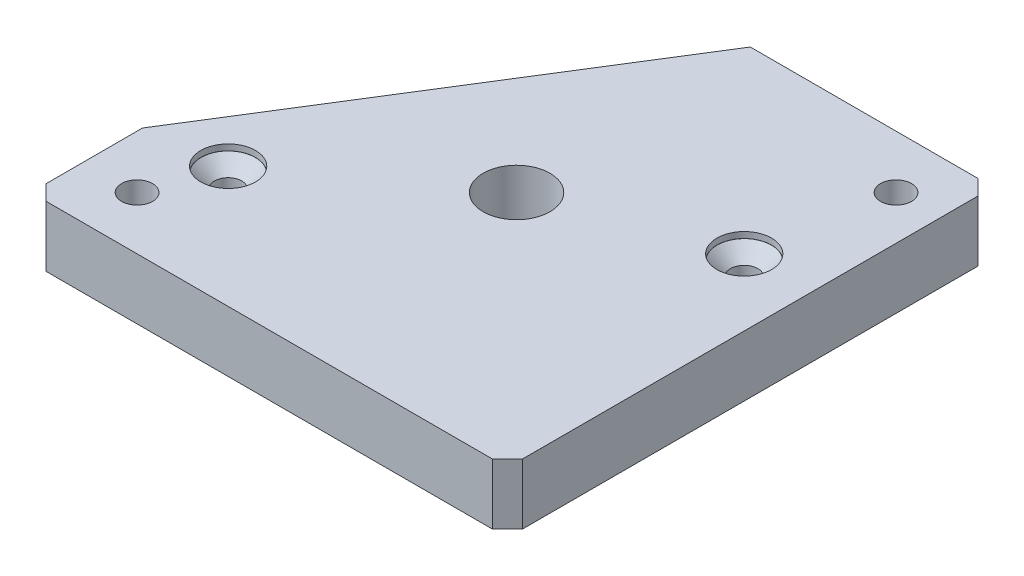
ISO-10303-21;
HEADER;
FILE_DESCRIPTION(('STEP AP214'),'2;1');
FILE_NAME('part.step','',(''),(''),'','','');
FILE_SCHEMA(('AUTOMOTIVE_DESIGN { 1 0 10303 214 1 1 1 1 }'));
ENDSEC;
DATA;
#1=APPLICATION_CONTEXT('core data for automotive mechanical design processes');
#2=APPLICATION_PROTOCOL_DEFINITION('international standard','automotive_design',2000,#1);
#3=PRODUCT_CONTEXT('',#1,'mechanical');
#4=PRODUCT('Part','Part','',(#3));
#5=PRODUCT_RELATED_PRODUCT_CATEGORY('part','',(#4));
#6=PRODUCT_DEFINITION_FORMATION('','',#4);
#7=PRODUCT_DEFINITION_CONTEXT('part definition',#1,'design');
#8=PRODUCT_DEFINITION('design','',#6,#7);
#9=PRODUCT_DEFINITION_SHAPE('','',#8);
#10=(LENGTH_UNIT() NAMED_UNIT(*) SI_UNIT(.MILLI.,.METRE.));
#11=(NAMED_UNIT(*) PLANE_ANGLE_UNIT() SI_UNIT($,.RADIAN.));
#12=(NAMED_UNIT(*) SI_UNIT($,.STERADIAN.) SOLID_ANGLE_UNIT());
#13=UNCERTAINTY_MEASURE_WITH_UNIT(LENGTH_MEASURE(1.E-05),#10,'distance_accuracy_value','');
#14=(GEOMETRIC_REPRESENTATION_CONTEXT(3) GLOBAL_UNCERTAINTY_ASSIGNED_CONTEXT((#13)) GLOBAL_UNIT_ASSIGNED_CONTEXT((#10,
#11,#12)) REPRESENTATION_CONTEXT('',''));
#15=CARTESIAN_POINT('',(0.,0.,0.));
#16=DIRECTION('',(0.,0.,1.));
#17=DIRECTION('',(1.,0.,0.));
#18=AXIS2_PLACEMENT_3D('',#15,#16,#17);
#19=CARTESIAN_POINT('',(0.,0.,-160.));
#20=DIRECTION('',(0.,-1.,0.));
#21=DIRECTION('',(0.,0.,-1.));
#22=AXIS2_PLACEMENT_3D('',#19,#20,#21);
#23=PLANE('',#22);
#24=DIRECTION('',(-0.5299192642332,0.,0.848048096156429));
#25=VECTOR('',#24,1.);
#26=CARTESIAN_POINT('',(0.,0.,-36.7742412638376));
#27=LINE('',#26,#25);
#28=CARTESIAN_POINT('',(77.,0.,-160.));
#29=VERTEX_POINT('',#28);
#30=CARTESIAN_POINT('',(0.,0.,-36.7742412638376));
#31=VERTEX_POINT('',#30);
#32=EDGE_CURVE('E104',#29,#31,#27,.T.);
#33=ORIENTED_EDGE('',*,*,#32,.F.);
#34=DIRECTION('',(-1.,0.,0.));
#35=VECTOR('',#34,1.);
#36=CARTESIAN_POINT('',(0.,0.,-160.));
#37=LINE('',#36,#35);
#38=CARTESIAN_POINT('',(152.,0.,-160.));
#39=VERTEX_POINT('',#38);
#40=EDGE_CURVE('E113',#39,#29,#37,.T.);
#41=ORIENTED_EDGE('',*,*,#40,.F.);
#42=DIRECTION('',(-0.707106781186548,0.,-0.707106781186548));
#43=VECTOR('',#42,1.);
#44=CARTESIAN_POINT('',(76.,0.,-236.));
#45=LINE('',#44,#43);
#46=CARTESIAN_POINT('',(157.,0.,-155.));
#47=VERTEX_POINT('',#46);
#48=EDGE_CURVE('E140',#39,#47,#45,.F.);
#49=ORIENTED_EDGE('',*,*,#48,.T.);
#50=DIRECTION('',(0.,0.,-1.));
#51=VECTOR('',#50,1.);
#52=CARTESIAN_POINT('',(157.,0.,0.));
#53=LINE('',#52,#51);
#54=CARTESIAN_POINT('',(157.,0.,-5.00000000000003));
#55=VERTEX_POINT('',#54);
#56=EDGE_CURVE('E120',#55,#47,#53,.T.);
#57=ORIENTED_EDGE('',*,*,#56,.F.);
#58=DIRECTION('',(0.707106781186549,0.,-0.707106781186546));
#59=VECTOR('',#58,1.);
#60=CARTESIAN_POINT('',(156.,0.,-3.99999999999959));
#61=LINE('',#60,#59);
#62=CARTESIAN_POINT('',(152.,0.,0.));
#63=VERTEX_POINT('',#62);
#64=EDGE_CURVE('E144',#55,#63,#61,.F.);
#65=ORIENTED_EDGE('',*,*,#64,.T.);
#66=DIRECTION('',(1.,0.,0.));
#67=VECTOR('',#66,1.);
#68=CARTESIAN_POINT('',(0.,0.,0.));
#69=LINE('',#68,#67);
#70=CARTESIAN_POINT('',(5.,0.,0.));
#71=VERTEX_POINT('',#70);
#72=EDGE_CURVE('E125',#71,#63,#69,.T.);
#73=ORIENTED_EDGE('',*,*,#72,.F.);
#74=DIRECTION('',(0.707106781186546,0.,0.707106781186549));
#75=VECTOR('',#74,1.);
#76=CARTESIAN_POINT('',(-77.5,0.,-82.5000000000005));
#77=LINE('',#76,#75);
#78=CARTESIAN_POINT('',(0.,0.,-5.00000000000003));
#79=VERTEX_POINT('',#78);
#80=EDGE_CURVE('E142',#71,#79,#77,.F.);
#81=ORIENTED_EDGE('',*,*,#80,.T.);
#82=DIRECTION('',(0.,0.,1.));
#83=VECTOR('',#82,1.);
#84=CARTESIAN_POINT('',(0.,0.,0.));
#85=LINE('',#84,#83);
#86=EDGE_CURVE('E115',#31,#79,#85,.T.);
#87=ORIENTED_EDGE('',*,*,#86,.F.);
#88=EDGE_LOOP('',(#33,#41,#49,#57,#65,#73,#81,#87));
#89=FACE_BOUND('',#88,.T.);
#90=CARTESIAN_POINT('',(135.,0.,-100.));
#91=DIRECTION('',(0.,1.,0.));
#92=DIRECTION('',(0.,0.,1.));
#93=AXIS2_PLACEMENT_3D('',#90,#91,#92);
#94=CIRCLE('',#93,4.5);
#95=CARTESIAN_POINT('',(135.,0.,-95.5));
#96=VERTEX_POINT('',#95);
#97=EDGE_CURVE('E222',#96,#96,#94,.T.);
#98=ORIENTED_EDGE('',*,*,#97,.T.);
#99=EDGE_LOOP('',(#98));
#100=FACE_BOUND('',#99,.T.);
#101=CARTESIAN_POINT('',(25.,0.,-40.));
#102=DIRECTION('',(0.,1.,0.));
#103=DIRECTION('',(0.,0.,1.));
#104=AXIS2_PLACEMENT_3D('',#101,#102,#103);
#105=CIRCLE('',#104,4.5);
#106=CARTESIAN_POINT('',(25.,0.,-35.5));
#107=VERTEX_POINT('',#106);
#108=EDGE_CURVE('E213',#107,#107,#105,.T.);
#109=ORIENTED_EDGE('',*,*,#108,.T.);
#110=EDGE_LOOP('',(#109));
#111=FACE_BOUND('',#110,.T.);
#112=CARTESIAN_POINT('',(17.5,0.,-17.5));
#113=DIRECTION('',(0.,1.,0.));
#114=DIRECTION('',(0.,0.,1.));
#115=AXIS2_PLACEMENT_3D('',#112,#113,#114);
#116=CIRCLE('',#115,5.09999999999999);
#117=CARTESIAN_POINT('',(17.5,0.,-12.4));
#118=VERTEX_POINT('',#117);
#119=EDGE_CURVE('E198',#118,#118,#116,.T.);
#120=ORIENTED_EDGE('',*,*,#119,.T.);
#121=EDGE_LOOP('',(#120));
#122=FACE_BOUND('',#121,.T.);
#123=CARTESIAN_POINT('',(80.,0.,-80.));
#124=DIRECTION('',(0.,1.,0.));
#125=DIRECTION('',(0.,0.,1.));
#126=AXIS2_PLACEMENT_3D('',#123,#124,#125);
#127=CIRCLE('',#126,11.);
#128=CARTESIAN_POINT('',(80.,0.,-69.));
#129=VERTEX_POINT('',#128);
#130=EDGE_CURVE('E181',#129,#129,#127,.T.);
#131=ORIENTED_EDGE('',*,*,#130,.T.);
#132=EDGE_LOOP('',(#131));
#133=FACE_BOUND('',#132,.T.);
#134=CARTESIAN_POINT('',(142.5,0.,-142.5));
#135=DIRECTION('',(0.,1.,0.));
#136=DIRECTION('',(0.,0.,1.));
#137=AXIS2_PLACEMENT_3D('',#134,#135,#136);
#138=CIRCLE('',#137,5.09999999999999);
#139=CARTESIAN_POINT('',(142.5,0.,-137.4));
#140=VERTEX_POINT('',#139);
#141=EDGE_CURVE('E192',#140,#140,#138,.T.);
#142=ORIENTED_EDGE('',*,*,#141,.T.);
#143=EDGE_LOOP('',(#142));
#144=FACE_BOUND('',#143,.T.);
#145=ADVANCED_FACE('F36',(#89,#100,#111,#122,#133,#144),#23,.T.);
#146=CARTESIAN_POINT('',(0.,20.,0.));
#147=DIRECTION('',(1.,0.,0.));
#148=DIRECTION('',(0.,0.,-1.));
#149=AXIS2_PLACEMENT_3D('',#146,#147,#148);
#150=PLANE('',#149);
#151=DIRECTION('',(0.,0.,1.));
#152=VECTOR('',#151,1.);
#153=CARTESIAN_POINT('',(0.,20.,0.));
#154=LINE('',#153,#152);
#155=CARTESIAN_POINT('',(0.,20.,-36.7742412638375));
#156=VERTEX_POINT('',#155);
#157=CARTESIAN_POINT('',(0.,20.,-5.00000000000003));
#158=VERTEX_POINT('',#157);
#159=EDGE_CURVE('E119',#156,#158,#154,.T.);
#160=ORIENTED_EDGE('',*,*,#159,.F.);
#161=DIRECTION('',(0.,-1.,0.));
#162=VECTOR('',#161,1.);
#163=CARTESIAN_POINT('',(0.,20.,-36.7742412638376));
#164=LINE('',#163,#162);
#165=EDGE_CURVE('E51',#156,#31,#164,.T.);
#166=ORIENTED_EDGE('',*,*,#165,.T.);
#167=ORIENTED_EDGE('',*,*,#86,.T.);
#168=DIRECTION('',(0.,1.,0.));
#169=VECTOR('',#168,1.);
#170=CARTESIAN_POINT('',(0.,20.,-5.00000000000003));
#171=LINE('',#170,#169);
#172=EDGE_CURVE('E44',#79,#158,#171,.T.);
#173=ORIENTED_EDGE('',*,*,#172,.T.);
#174=EDGE_LOOP('',(#160,#166,#167,#173));
#175=FACE_BOUND('',#174,.T.);
#176=ADVANCED_FACE('F38',(#175),#150,.F.);
#177=CARTESIAN_POINT('',(0.,20.,0.));
#178=DIRECTION('',(0.,0.,-1.));
#179=DIRECTION('',(-1.,0.,0.));
#180=AXIS2_PLACEMENT_3D('',#177,#178,#179);
#181=PLANE('',#180);
#182=ORIENTED_EDGE('',*,*,#72,.T.);
#183=DIRECTION('',(0.,1.,0.));
#184=VECTOR('',#183,1.);
#185=CARTESIAN_POINT('',(152.,20.,0.));
#186=LINE('',#185,#184);
#187=CARTESIAN_POINT('',(152.,20.,0.));
#188=VERTEX_POINT('',#187);
#189=EDGE_CURVE('E149',#63,#188,#186,.T.);
#190=ORIENTED_EDGE('',*,*,#189,.T.);
#191=DIRECTION('',(1.,0.,0.));
#192=VECTOR('',#191,1.);
#193=CARTESIAN_POINT('',(0.,20.,0.));
#194=LINE('',#193,#192);
#195=CARTESIAN_POINT('',(5.,20.,0.));
#196=VERTEX_POINT('',#195);
#197=EDGE_CURVE('E122',#196,#188,#194,.T.);
#198=ORIENTED_EDGE('',*,*,#197,.F.);
#199=DIRECTION('',(0.,-1.,0.));
#200=VECTOR('',#199,1.);
#201=CARTESIAN_POINT('',(5.,20.,0.));
#202=LINE('',#201,#200);
#203=EDGE_CURVE('E146',#196,#71,#202,.T.);
#204=ORIENTED_EDGE('',*,*,#203,.T.);
#205=EDGE_LOOP('',(#182,#190,#198,#204));
#206=FACE_BOUND('',#205,.T.);
#207=ADVANCED_FACE('F168',(#206),#181,.F.);
#208=CARTESIAN_POINT('',(157.,20.,0.));
#209=DIRECTION('',(-1.,0.,0.));
#210=DIRECTION('',(0.,0.,1.));
#211=AXIS2_PLACEMENT_3D('',#208,#209,#210);
#212=PLANE('',#211);
#213=DIRECTION('',(0.,0.,-1.));
#214=VECTOR('',#213,1.);
#215=CARTESIAN_POINT('',(157.,20.,0.));
#216=LINE('',#215,#214);
#217=CARTESIAN_POINT('',(157.,20.,-5.));
#218=VERTEX_POINT('',#217);
#219=CARTESIAN_POINT('',(157.,20.,-155.));
#220=VERTEX_POINT('',#219);
#221=EDGE_CURVE('E131',#218,#220,#216,.T.);
#222=ORIENTED_EDGE('',*,*,#221,.F.);
#223=DIRECTION('',(0.,-1.,0.));
#224=VECTOR('',#223,1.);
#225=CARTESIAN_POINT('',(157.,20.,-5.));
#226=LINE('',#225,#224);
#227=EDGE_CURVE('E137',#218,#55,#226,.T.);
#228=ORIENTED_EDGE('',*,*,#227,.T.);
#229=ORIENTED_EDGE('',*,*,#56,.T.);
#230=DIRECTION('',(0.,1.,0.));
#231=VECTOR('',#230,1.);
#232=CARTESIAN_POINT('',(157.,20.,-155.));
#233=LINE('',#232,#231);
#234=EDGE_CURVE('E135',#47,#220,#233,.T.);
#235=ORIENTED_EDGE('',*,*,#234,.T.);
#236=EDGE_LOOP('',(#222,#228,#229,#235));
#237=FACE_BOUND('',#236,.T.);
#238=ADVANCED_FACE('F176',(#237),#212,.F.);
#239=CARTESIAN_POINT('',(0.,20.,-160.));
#240=DIRECTION('',(0.,0.,1.));
#241=DIRECTION('',(1.,0.,0.));
#242=AXIS2_PLACEMENT_3D('',#239,#240,#241);
#243=PLANE('',#242);
#244=ORIENTED_EDGE('',*,*,#40,.T.);
#245=DIRECTION('',(0.,-1.,0.));
#246=VECTOR('',#245,1.);
#247=CARTESIAN_POINT('',(77.,20.,-160.));
#248=LINE('',#247,#246);
#249=CARTESIAN_POINT('',(77.,20.,-160.));
#250=VERTEX_POINT('',#249);
#251=EDGE_CURVE('E101',#250,#29,#248,.T.);
#252=ORIENTED_EDGE('',*,*,#251,.F.);
#253=DIRECTION('',(-1.,0.,0.));
#254=VECTOR('',#253,1.);
#255=CARTESIAN_POINT('',(0.,20.,-160.));
#256=LINE('',#255,#254);
#257=CARTESIAN_POINT('',(152.,20.,-160.));
#258=VERTEX_POINT('',#257);
#259=EDGE_CURVE('E133',#258,#250,#256,.T.);
#260=ORIENTED_EDGE('',*,*,#259,.F.);
#261=DIRECTION('',(0.,-1.,0.));
#262=VECTOR('',#261,1.);
#263=CARTESIAN_POINT('',(152.,20.,-160.));
#264=LINE('',#263,#262);
#265=EDGE_CURVE('E11',#258,#39,#264,.T.);
#266=ORIENTED_EDGE('',*,*,#265,.T.);
#267=EDGE_LOOP('',(#244,#252,#260,#266));
#268=FACE_BOUND('',#267,.T.);
#269=ADVANCED_FACE('F117',(#268),#243,.F.);
#270=CARTESIAN_POINT('',(0.,20.,-160.));
#271=DIRECTION('',(0.,-1.,0.));
#272=DIRECTION('',(0.,0.,-1.));
#273=AXIS2_PLACEMENT_3D('',#270,#271,#272);
#274=PLANE('',#273);
#275=CARTESIAN_POINT('',(25.,20.,-40.));
#276=DIRECTION('',(0.,1.,0.));
#277=DIRECTION('',(0.,0.,1.));
#278=AXIS2_PLACEMENT_3D('',#275,#276,#277);
#279=CIRCLE('',#278,9.);
#280=CARTESIAN_POINT('',(25.,20.,-31.));
#281=VERTEX_POINT('',#280);
#282=EDGE_CURVE('E210',#281,#281,#279,.T.);
#283=ORIENTED_EDGE('',*,*,#282,.F.);
#284=EDGE_LOOP('',(#283));
#285=FACE_BOUND('',#284,.T.);
#286=CARTESIAN_POINT('',(135.,20.,-100.));
#287=DIRECTION('',(0.,1.,0.));
#288=DIRECTION('',(0.,0.,1.));
#289=AXIS2_PLACEMENT_3D('',#286,#287,#288);
#290=CIRCLE('',#289,9.00000000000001);
#291=CARTESIAN_POINT('',(135.,20.,-91.));
#292=VERTEX_POINT('',#291);
#293=EDGE_CURVE('E204',#292,#292,#290,.T.);
#294=ORIENTED_EDGE('',*,*,#293,.F.);
#295=EDGE_LOOP('',(#294));
#296=FACE_BOUND('',#295,.T.);
#297=CARTESIAN_POINT('',(17.5,20.,-17.5));
#298=DIRECTION('',(0.,1.,0.));
#299=DIRECTION('',(0.,0.,1.));
#300=AXIS2_PLACEMENT_3D('',#297,#298,#299);
#301=CIRCLE('',#300,5.09999999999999);
#302=CARTESIAN_POINT('',(17.5,20.,-12.4));
#303=VERTEX_POINT('',#302);
#304=EDGE_CURVE('E195',#303,#303,#301,.T.);
#305=ORIENTED_EDGE('',*,*,#304,.F.);
#306=EDGE_LOOP('',(#305));
#307=FACE_BOUND('',#306,.T.);
#308=CARTESIAN_POINT('',(142.5,20.,-142.5));
#309=DIRECTION('',(0.,1.,0.));
#310=DIRECTION('',(0.,0.,1.));
#311=AXIS2_PLACEMENT_3D('',#308,#309,#310);
#312=CIRCLE('',#311,5.09999999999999);
#313=CARTESIAN_POINT('',(142.5,20.,-137.4));
#314=VERTEX_POINT('',#313);
#315=EDGE_CURVE('E189',#314,#314,#312,.T.);
#316=ORIENTED_EDGE('',*,*,#315,.F.);
#317=EDGE_LOOP('',(#316));
#318=FACE_BOUND('',#317,.T.);
#319=CARTESIAN_POINT('',(80.,20.,-80.));
#320=DIRECTION('',(0.,1.,0.));
#321=DIRECTION('',(0.,0.,1.));
#322=AXIS2_PLACEMENT_3D('',#319,#320,#321);
#323=CIRCLE('',#322,11.);
#324=CARTESIAN_POINT('',(80.,20.,-69.));
#325=VERTEX_POINT('',#324);
#326=EDGE_CURVE('E186',#325,#325,#323,.T.);
#327=ORIENTED_EDGE('',*,*,#326,.F.);
#328=EDGE_LOOP('',(#327));
#329=FACE_BOUND('',#328,.T.);
#330=ORIENTED_EDGE('',*,*,#259,.T.);
#331=DIRECTION('',(-0.5299192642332,0.,0.848048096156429));
#332=VECTOR('',#331,1.);
#333=CARTESIAN_POINT('',(0.,20.,-36.7742412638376));
#334=LINE('',#333,#332);
#335=EDGE_CURVE('E105',#250,#156,#334,.T.);
#336=ORIENTED_EDGE('',*,*,#335,.T.);
#337=ORIENTED_EDGE('',*,*,#159,.T.);
#338=DIRECTION('',(-0.707106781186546,0.,-0.707106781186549));
#339=VECTOR('',#338,1.);
#340=CARTESIAN_POINT('',(5.,20.,0.));
#341=LINE('',#340,#339);
#342=EDGE_CURVE('E152',#158,#196,#341,.F.);
#343=ORIENTED_EDGE('',*,*,#342,.T.);
#344=ORIENTED_EDGE('',*,*,#197,.T.);
#345=DIRECTION('',(-0.707106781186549,0.,0.707106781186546));
#346=VECTOR('',#345,1.);
#347=CARTESIAN_POINT('',(157.,20.,-5.));
#348=LINE('',#347,#346);
#349=EDGE_CURVE('E154',#188,#218,#348,.F.);
#350=ORIENTED_EDGE('',*,*,#349,.T.);
#351=ORIENTED_EDGE('',*,*,#221,.T.);
#352=DIRECTION('',(0.707106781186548,0.,0.707106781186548));
#353=VECTOR('',#352,1.);
#354=CARTESIAN_POINT('',(152.,20.,-160.));
#355=LINE('',#354,#353);
#356=EDGE_CURVE('E59',#220,#258,#355,.F.);
#357=ORIENTED_EDGE('',*,*,#356,.T.);
#358=EDGE_LOOP('',(#330,#336,#337,#343,#344,#350,#351,#357));
#359=FACE_BOUND('',#358,.T.);
#360=ADVANCED_FACE('F164',(#285,#296,#307,#318,#329,#359),#274,.F.);
#361=CARTESIAN_POINT('',(80.,0.,-80.));
#362=DIRECTION('',(0.,1.,0.));
#363=DIRECTION('',(0.,0.,1.));
#364=AXIS2_PLACEMENT_3D('',#361,#362,#363);
#365=CYLINDRICAL_SURFACE('',#364,11.);
#366=ORIENTED_EDGE('',*,*,#130,.F.);
#367=EDGE_LOOP('',(#366));
#368=FACE_BOUND('',#367,.T.);
#369=ORIENTED_EDGE('',*,*,#326,.T.);
#370=EDGE_LOOP('',(#369));
#371=FACE_BOUND('',#370,.T.);
#372=ADVANCED_FACE('F251',(#368,#371),#365,.F.);
#373=CARTESIAN_POINT('',(142.5,20.,-142.5));
#374=DIRECTION('',(0.,1.,0.));
#375=DIRECTION('',(0.,0.,1.));
#376=AXIS2_PLACEMENT_3D('',#373,#374,#375);
#377=CYLINDRICAL_SURFACE('',#376,5.09999999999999);
#378=ORIENTED_EDGE('',*,*,#141,.F.);
#379=EDGE_LOOP('',(#378));
#380=FACE_BOUND('',#379,.T.);
#381=ORIENTED_EDGE('',*,*,#315,.T.);
#382=EDGE_LOOP('',(#381));
#383=FACE_BOUND('',#382,.T.);
#384=ADVANCED_FACE('F261',(#380,#383),#377,.F.);
#385=CARTESIAN_POINT('',(17.5,20.,-17.5));
#386=DIRECTION('',(0.,1.,0.));
#387=DIRECTION('',(0.,0.,1.));
#388=AXIS2_PLACEMENT_3D('',#385,#386,#387);
#389=CYLINDRICAL_SURFACE('',#388,5.09999999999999);
#390=ORIENTED_EDGE('',*,*,#119,.F.);
#391=EDGE_LOOP('',(#390));
#392=FACE_BOUND('',#391,.T.);
#393=ORIENTED_EDGE('',*,*,#304,.T.);
#394=EDGE_LOOP('',(#393));
#395=FACE_BOUND('',#394,.T.);
#396=ADVANCED_FACE('F267',(#392,#395),#389,.F.);
#397=CARTESIAN_POINT('',(157.,20.,-5.));
#398=DIRECTION('',(-0.707106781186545,0.,-0.707106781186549));
#399=DIRECTION('',(-0.707106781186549,0.,0.707106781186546));
#400=AXIS2_PLACEMENT_3D('',#397,#398,#399);
#401=PLANE('',#400);
#402=ORIENTED_EDGE('',*,*,#349,.F.);
#403=ORIENTED_EDGE('',*,*,#189,.F.);
#404=ORIENTED_EDGE('',*,*,#64,.F.);
#405=ORIENTED_EDGE('',*,*,#227,.F.);
#406=EDGE_LOOP('',(#402,#403,#404,#405));
#407=FACE_BOUND('',#406,.T.);
#408=ADVANCED_FACE('F172',(#407),#401,.F.);
#409=CARTESIAN_POINT('',(5.,20.,0.));
#410=DIRECTION('',(0.707106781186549,0.,-0.707106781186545));
#411=DIRECTION('',(-0.707106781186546,0.,-0.707106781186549));
#412=AXIS2_PLACEMENT_3D('',#409,#410,#411);
#413=PLANE('',#412);
#414=ORIENTED_EDGE('',*,*,#342,.F.);
#415=ORIENTED_EDGE('',*,*,#172,.F.);
#416=ORIENTED_EDGE('',*,*,#80,.F.);
#417=ORIENTED_EDGE('',*,*,#203,.F.);
#418=EDGE_LOOP('',(#414,#415,#416,#417));
#419=FACE_BOUND('',#418,.T.);
#420=ADVANCED_FACE('F162',(#419),#413,.F.);
#421=CARTESIAN_POINT('',(152.,20.,-160.));
#422=DIRECTION('',(-0.707106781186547,0.,0.707106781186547));
#423=DIRECTION('',(0.707106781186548,0.,0.707106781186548));
#424=AXIS2_PLACEMENT_3D('',#421,#422,#423);
#425=PLANE('',#424);
#426=ORIENTED_EDGE('',*,*,#356,.F.);
#427=ORIENTED_EDGE('',*,*,#234,.F.);
#428=ORIENTED_EDGE('',*,*,#48,.F.);
#429=ORIENTED_EDGE('',*,*,#265,.F.);
#430=EDGE_LOOP('',(#426,#427,#428,#429));
#431=FACE_BOUND('',#430,.T.);
#432=ADVANCED_FACE('F180',(#431),#425,.F.);
#433=CARTESIAN_POINT('',(135.,18.,-100.));
#434=DIRECTION('',(0.,1.,0.));
#435=DIRECTION('',(0.,0.,1.));
#436=AXIS2_PLACEMENT_3D('',#433,#434,#435);
#437=CYLINDRICAL_SURFACE('',#436,9.00000000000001);
#438=CARTESIAN_POINT('',(135.,18.,-100.));
#439=DIRECTION('',(0.,1.,0.));
#440=DIRECTION('',(0.,0.,1.));
#441=AXIS2_PLACEMENT_3D('',#438,#439,#440);
#442=CIRCLE('',#441,9.00000000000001);
#443=CARTESIAN_POINT('',(135.,18.,-91.));
#444=VERTEX_POINT('',#443);
#445=EDGE_CURVE('E201',#444,#444,#442,.T.);
#446=ORIENTED_EDGE('',*,*,#445,.F.);
#447=EDGE_LOOP('',(#446));
#448=FACE_BOUND('',#447,.T.);
#449=ORIENTED_EDGE('',*,*,#293,.T.);
#450=EDGE_LOOP('',(#449));
#451=FACE_BOUND('',#450,.T.);
#452=ADVANCED_FACE('F240',(#448,#451),#437,.F.);
#453=CARTESIAN_POINT('',(135.,18.,-100.));
#454=DIRECTION('',(0.,1.,0.));
#455=DIRECTION('',(0.,0.,1.));
#456=AXIS2_PLACEMENT_3D('',#453,#454,#455);
#457=PLANE('',#456);
#458=CARTESIAN_POINT('',(135.,18.,-100.));
#459=DIRECTION('',(0.,1.,0.));
#460=DIRECTION('',(0.,0.,1.));
#461=AXIS2_PLACEMENT_3D('',#458,#459,#460);
#462=CIRCLE('',#461,8.96);
#463=CARTESIAN_POINT('',(135.,18.,-91.04));
#464=VERTEX_POINT('',#463);
#465=EDGE_CURVE('E228',#464,#464,#462,.T.);
#466=ORIENTED_EDGE('',*,*,#465,.F.);
#467=EDGE_LOOP('',(#466));
#468=FACE_BOUND('',#467,.T.);
#469=ORIENTED_EDGE('',*,*,#445,.T.);
#470=EDGE_LOOP('',(#469));
#471=FACE_BOUND('',#470,.T.);
#472=ADVANCED_FACE('F236',(#468,#471),#457,.T.);
#473=CARTESIAN_POINT('',(25.,18.,-40.));
#474=DIRECTION('',(0.,1.,0.));
#475=DIRECTION('',(0.,0.,1.));
#476=AXIS2_PLACEMENT_3D('',#473,#474,#475);
#477=CYLINDRICAL_SURFACE('',#476,9.);
#478=CARTESIAN_POINT('',(25.,18.,-40.));
#479=DIRECTION('',(0.,1.,0.));
#480=DIRECTION('',(0.,0.,1.));
#481=AXIS2_PLACEMENT_3D('',#478,#479,#480);
#482=CIRCLE('',#481,9.);
#483=CARTESIAN_POINT('',(25.,18.,-31.));
#484=VERTEX_POINT('',#483);
#485=EDGE_CURVE('E207',#484,#484,#482,.T.);
#486=ORIENTED_EDGE('',*,*,#485,.F.);
#487=EDGE_LOOP('',(#486));
#488=FACE_BOUND('',#487,.T.);
#489=ORIENTED_EDGE('',*,*,#282,.T.);
#490=EDGE_LOOP('',(#489));
#491=FACE_BOUND('',#490,.T.);
#492=ADVANCED_FACE('F239',(#488,#491),#477,.F.);
#493=CARTESIAN_POINT('',(25.,18.,-40.));
#494=DIRECTION('',(0.,1.,0.));
#495=DIRECTION('',(0.,0.,1.));
#496=AXIS2_PLACEMENT_3D('',#493,#494,#495);
#497=PLANE('',#496);
#498=CARTESIAN_POINT('',(25.,18.,-40.));
#499=DIRECTION('',(0.,1.,0.));
#500=DIRECTION('',(0.,0.,1.));
#501=AXIS2_PLACEMENT_3D('',#498,#499,#500);
#502=CIRCLE('',#501,8.96);
#503=CARTESIAN_POINT('',(25.,18.,-31.04));
#504=VERTEX_POINT('',#503);
#505=EDGE_CURVE('E219',#504,#504,#502,.T.);
#506=ORIENTED_EDGE('',*,*,#505,.F.);
#507=EDGE_LOOP('',(#506));
#508=FACE_BOUND('',#507,.T.);
#509=ORIENTED_EDGE('',*,*,#485,.T.);
#510=EDGE_LOOP('',(#509));
#511=FACE_BOUND('',#510,.T.);
#512=ADVANCED_FACE('F340',(#508,#511),#497,.T.);
#513=CARTESIAN_POINT('',(25.,18.,-40.));
#514=DIRECTION('',(0.,1.,0.));
#515=DIRECTION('',(0.,0.,1.));
#516=AXIS2_PLACEMENT_3D('',#513,#514,#515);
#517=CYLINDRICAL_SURFACE('',#516,4.5);
#518=ORIENTED_EDGE('',*,*,#108,.F.);
#519=EDGE_LOOP('',(#518));
#520=FACE_BOUND('',#519,.T.);
#521=CARTESIAN_POINT('',(25.,13.54,-40.));
#522=DIRECTION('',(0.,1.,0.));
#523=DIRECTION('',(0.,0.,1.));
#524=AXIS2_PLACEMENT_3D('',#521,#522,#523);
#525=CIRCLE('',#524,4.49999999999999);
#526=CARTESIAN_POINT('',(25.,13.54,-35.5));
#527=VERTEX_POINT('',#526);
#528=EDGE_CURVE('E216',#527,#527,#525,.T.);
#529=ORIENTED_EDGE('',*,*,#528,.T.);
#530=EDGE_LOOP('',(#529));
#531=FACE_BOUND('',#530,.T.);
#532=ADVANCED_FACE('F332',(#520,#531),#517,.F.);
#533=CARTESIAN_POINT('',(25.,18.,-40.));
#534=DIRECTION('',(0.,1.,0.));
#535=DIRECTION('',(0.,0.,1.));
#536=AXIS2_PLACEMENT_3D('',#533,#534,#535);
#537=CONICAL_SURFACE('',#536,8.96,0.785398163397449);
#538=ORIENTED_EDGE('',*,*,#528,.F.);
#539=EDGE_LOOP('',(#538));
#540=FACE_BOUND('',#539,.T.);
#541=ORIENTED_EDGE('',*,*,#505,.T.);
#542=EDGE_LOOP('',(#541));
#543=FACE_BOUND('',#542,.T.);
#544=ADVANCED_FACE('F324',(#540,#543),#537,.F.);
#545=CARTESIAN_POINT('',(135.,18.,-100.));
#546=DIRECTION('',(0.,1.,0.));
#547=DIRECTION('',(0.,0.,1.));
#548=AXIS2_PLACEMENT_3D('',#545,#546,#547);
#549=CYLINDRICAL_SURFACE('',#548,4.49999999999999);
#550=ORIENTED_EDGE('',*,*,#97,.F.);
#551=EDGE_LOOP('',(#550));
#552=FACE_BOUND('',#551,.T.);
#553=CARTESIAN_POINT('',(135.,13.54,-100.));
#554=DIRECTION('',(0.,1.,0.));
#555=DIRECTION('',(0.,0.,1.));
#556=AXIS2_PLACEMENT_3D('',#553,#554,#555);
#557=CIRCLE('',#556,4.49999999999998);
#558=CARTESIAN_POINT('',(135.,13.54,-95.5));
#559=VERTEX_POINT('',#558);
#560=EDGE_CURVE('E225',#559,#559,#557,.T.);
#561=ORIENTED_EDGE('',*,*,#560,.T.);
#562=EDGE_LOOP('',(#561));
#563=FACE_BOUND('',#562,.T.);
#564=ADVANCED_FACE('F317',(#552,#563),#549,.F.);
#565=CARTESIAN_POINT('',(135.,18.,-100.));
#566=DIRECTION('',(0.,1.,0.));
#567=DIRECTION('',(0.,0.,1.));
#568=AXIS2_PLACEMENT_3D('',#565,#566,#567);
#569=CONICAL_SURFACE('',#568,8.96,0.78539816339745);
#570=ORIENTED_EDGE('',*,*,#560,.F.);
#571=EDGE_LOOP('',(#570));
#572=FACE_BOUND('',#571,.T.);
#573=ORIENTED_EDGE('',*,*,#465,.T.);
#574=EDGE_LOOP('',(#573));
#575=FACE_BOUND('',#574,.T.);
#576=ADVANCED_FACE('F234',(#572,#575),#569,.F.);
#577=CARTESIAN_POINT('',(0.,20.,-36.7742412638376));
#578=DIRECTION('',(0.848048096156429,0.,0.5299192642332));
#579=DIRECTION('',(0.5299192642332,0.,-0.848048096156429));
#580=AXIS2_PLACEMENT_3D('',#577,#578,#579);
#581=PLANE('',#580);
#582=ORIENTED_EDGE('',*,*,#32,.T.);
#583=ORIENTED_EDGE('',*,*,#165,.F.);
#584=ORIENTED_EDGE('',*,*,#335,.F.);
#585=ORIENTED_EDGE('',*,*,#251,.T.);
#586=EDGE_LOOP('',(#582,#583,#584,#585));
#587=FACE_BOUND('',#586,.T.);
#588=ADVANCED_FACE('F103',(#587),#581,.F.);
#589=CLOSED_SHELL('',(#145,#176,#207,#238,#269,#360,#372,#384,#396,#408,#420,#432,#452,#472,
#492,#512,#532,#544,#564,#576,#588));
#590=MANIFOLD_SOLID_BREP('B2',#589);
#591=ADVANCED_BREP_SHAPE_REPRESENTATION('',(#18,#590),#14);
#592=SHAPE_DEFINITION_REPRESENTATION(#9,#591);
ENDSEC;
END-ISO-10303-21;
